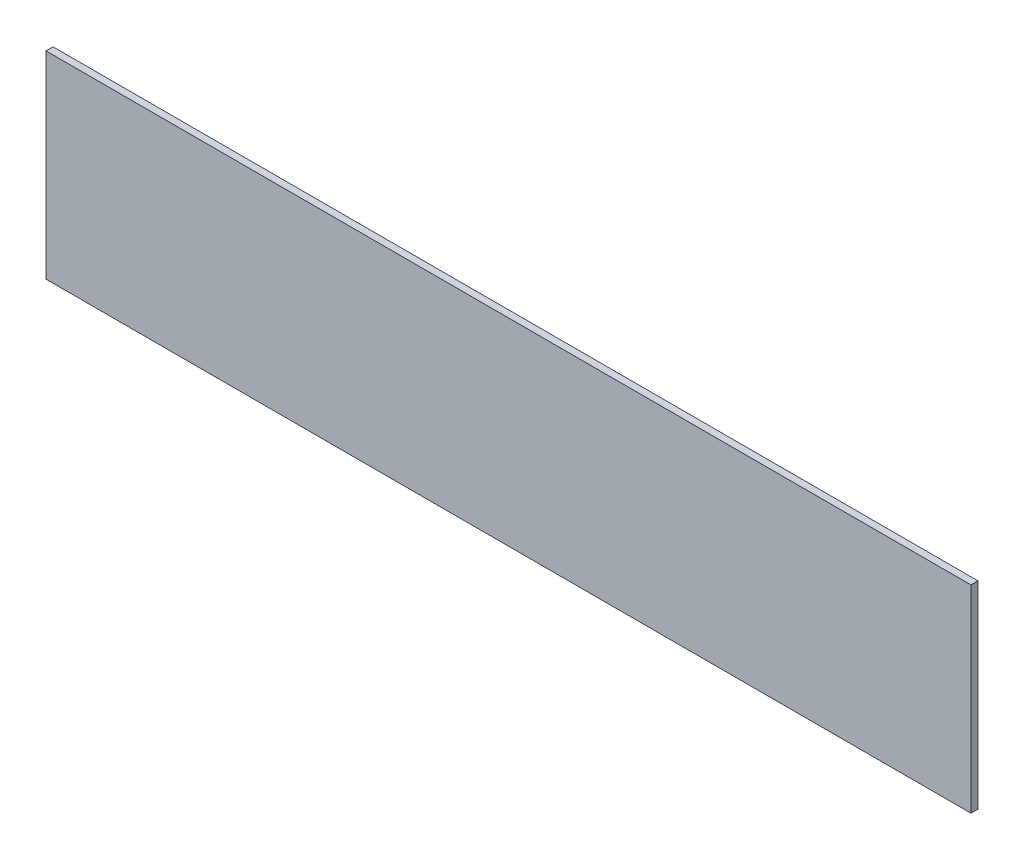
from build123d import *

# Parameters (mm, degrees)
SKETCH1_W           = 415.925
SKETCH1_H           = 88.9
BOSS_EXTRUDE1_DEPTH = 3.175


with BuildPart() as part:
    # Sketch1 → Boss-Extrude1 (new body)
    with BuildSketch(Plane.XY):
        Rectangle(SKETCH1_W, SKETCH1_H)
    extrude(amount=BOSS_EXTRUDE1_DEPTH)


solid = part.part
